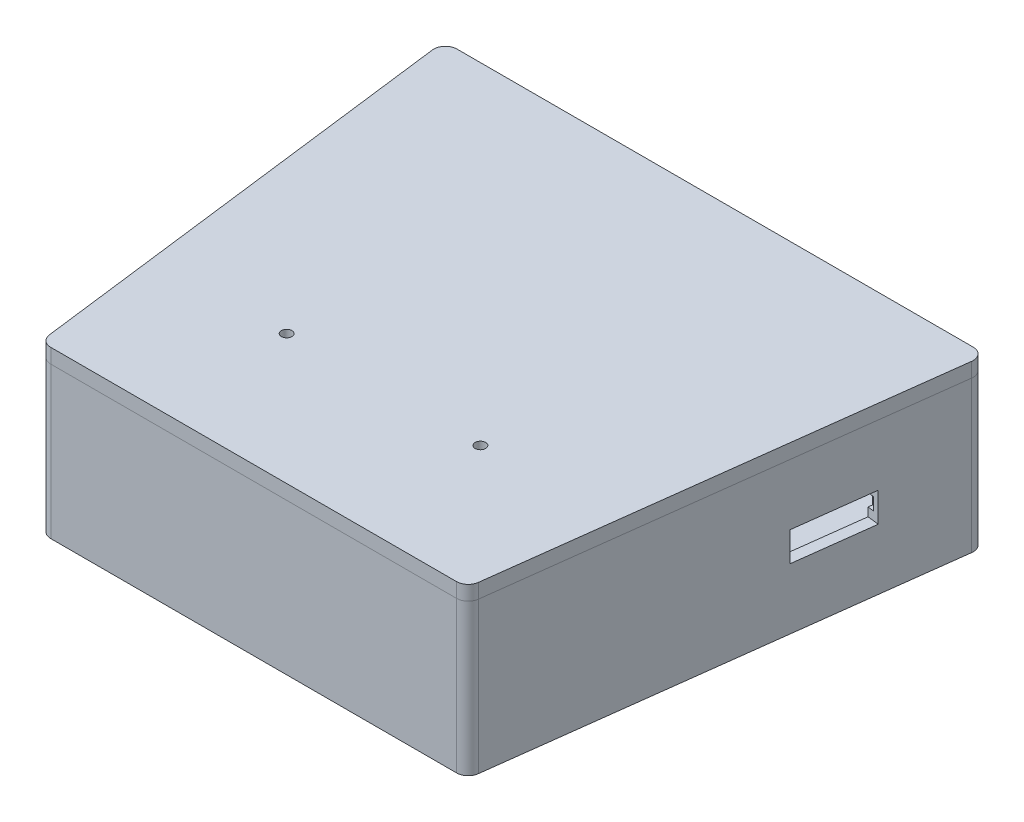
from build123d import *

# Parameters (mm, degrees)
BOSS_EXTRUDE1_DEPTH = 5.08
BOSS_EXTRUDE2_DEPTH = 44.45
CUT_EXTRUDE1_REACH  = 226.761
SKETCH3_R           = 3.175
CUT_EXTRUDE2_REACH  = 226.761
SKETCH4_R           = 11.43
CUT_EXTRUDE3_REACH  = 237.306
SKETCH6_W           = 25.908
SKETCH6_H           = 9.652
SKETCH7_W           = 1.27
SKETCH7_H           = 4.064
CUT_EXTRUDE4_DEPTH  = 2.032
SKETCH10_R          = 22.86
SKETCH10_R_2        = 1.7272
BOSS_EXTRUDE3_DEPTH = 44.45
FILLET1_R           = 1.27
FILLET2_R           = 3.81
FILLET3_R           = 3.81
SKETCH16_R          = 1.7272
BOSS_EXTRUDE4_DEPTH = 4.7625


with BuildPart() as part:
    # Sketch1 → Boss-Extrude1 (new body)
    with BuildSketch(Plane(origin=(0, 0, 0), x_dir=(1, 0, 0), z_dir=(0, 1, 0))):
        Polygon((0, 0), (139.7, 0), (158.75, 151.204687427), (-19.05, 151.204687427), align=None)
    extrude(amount=BOSS_EXTRUDE1_DEPTH)

    # Sketch2 → Boss-Extrude2 (add)
    with BuildSketch(Plane(origin=(0, 5.08, 0), x_dir=(1, 0, 0), z_dir=(0, 1, 0))):
        Polygon((-19.05, 151.204687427), (158.75, 151.204687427), (139.7, 0), (0, 0), align=None)
        Polygon((-14.729866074, 147.394687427), (3.360104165, 3.81), (136.339895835, 3.81), (154.429866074, 147.394687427), align=None, mode=Mode.SUBTRACT)
    extrude(amount=BOSS_EXTRUDE2_DEPTH)

    # Sketch3 → Cut-Extrude1 (cut, up to next)
    with BuildSketch(Plane(origin=(0, 0, -151.204687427), x_dir=(-1, 0, 0), z_dir=(0, 0, -1)), mode=Mode.PRIVATE) as cut_extrude1_sk1:
        with Locations((-79.375, 38.1)):
            Circle(SKETCH3_R)
    cut_extrude1_tool1 = extrude(cut_extrude1_sk1.sketch, amount=-CUT_EXTRUDE1_REACH, mode=Mode.PRIVATE) & part.part
    # Sketch3 → Cut-Extrude1 (cut, up to next)
    with BuildSketch(Plane(origin=(0, 0, -151.204687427), x_dir=(-1, 0, 0), z_dir=(0, 0, -1)), mode=Mode.PRIVATE) as cut_extrude1_sk2:
        with Locations(Location((-60.325, 38.1, 0), (0, 0, 180))):
            Circle(SKETCH3_R)
    cut_extrude1_tool2 = extrude(cut_extrude1_sk2.sketch, amount=-CUT_EXTRUDE1_REACH, mode=Mode.PRIVATE) & part.part
    add(cut_extrude1_tool1.solids().sort_by_distance((79.375, 38.1, -151.204687))[0], mode=Mode.SUBTRACT)
    add(cut_extrude1_tool2.solids().sort_by_distance((60.325, 38.1, -151.204687))[0], mode=Mode.SUBTRACT)

    # Sketch4 → Cut-Extrude2 (cut, up to next)
    with BuildSketch(Plane.XZ, mode=Mode.PRIVATE) as cut_extrude2_sk1:
        with Locations(Location((69.85, -124.534687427, 0), (0, 0, 270))):
            Circle(SKETCH4_R)
    cut_extrude2_tool1 = extrude(cut_extrude2_sk1.sketch, amount=-CUT_EXTRUDE2_REACH, mode=Mode.PRIVATE) & part.part
    add(cut_extrude2_tool1.solids().sort_by_distance((69.85, 0, -124.534687))[0], mode=Mode.SUBTRACT)

    # Sketch6 → Cut-Extrude3 (cut, up to next)
    with BuildSketch(Plane(origin=(137.5171875, 0, 17.325537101), x_dir=(0.12499999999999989, 0, -0.9921567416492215), z_dir=(0.9921567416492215, 0, 0.12499999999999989)), mode=Mode.PRIVATE) as cut_extrude3_sk1:
        with Locations((125.1585, 24.765)):
            Rectangle(SKETCH6_W, SKETCH6_H)
    cut_extrude3_tool1 = extrude(cut_extrude3_sk1.sketch, amount=-CUT_EXTRUDE3_REACH, mode=Mode.PRIVATE) & part.part
    cut_extrude3 = cut_extrude3_tool1.solids().sort_by_distance((153.162, 24.765, -106.851312))[0]
    add(cut_extrude3, mode=Mode.SUBTRACT)

    # Sketch7 → Cut-Extrude4 (cut)
    with BuildSketch(Plane(origin=(133.737070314, 0, 16.849287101), x_dir=(-0.12499999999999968, 0, 0.9921567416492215), z_dir=(-0.9921567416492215, 0, -0.12499999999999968))):
        with Locations((-138.7475, 24.765)):
            Rectangle(SKETCH7_W, SKETCH7_H)
        with Locations((-111.5695, 24.765)):
            Rectangle(SKETCH7_W, SKETCH7_H)
    cut_extrude4 = extrude(amount=-CUT_EXTRUDE4_DEPTH, mode=Mode.SUBTRACT)

    # Mirror3: Cut-Extrude4 across plane
    add(cut_extrude4.mirror(Plane(origin=(69.85, 0, 0), x_dir=(0, 0, 1), z_dir=(1, 0, 0))), mode=Mode.SUBTRACT)

    # Sketch10 → Boss-Extrude3 (add)
    # profile 1 of 3: a face of its own
    with BuildSketch(Plane(origin=(0, 5.08, 0), x_dir=(1, 0, 0), z_dir=(0, 1, 0))):
        with Locations(Location((38.1, 42.545, 0), (0, 0, 90))):
            Circle(SKETCH10_R)
        with Locations(Location((38.1, 42.545, 0), (0, 0, 270))):
            Circle(SKETCH10_R_2, mode=Mode.SUBTRACT)
    # profile 2 of 3: a face of its own
    with BuildSketch(Plane(origin=(0, 5.08, 0), x_dir=(1, 0, 0), z_dir=(0, 1, 0))):
        with Locations(Location((101.6, 42.545, 0), (0, 0, 270))):
            Circle(SKETCH10_R)
        with Locations(Location((101.6, 42.545, 0), (0, 0, 90))):
            Circle(SKETCH10_R_2, mode=Mode.SUBTRACT)
    # profile 3 of 3: a face of its own
    with BuildSketch(Plane(origin=(0, 5.08, 0), x_dir=(1, 0, 0), z_dir=(0, 1, 0))):
        with BuildLine():
            Line((38.1, 13.97), (101.6, 13.97))
            ThreePointArc((101.6, 13.97), (130.175, 42.545), (101.6, 71.12))
            Line((101.6, 71.12), (101.6, 74.93))
            ThreePointArc((101.6, 74.93), (133.985, 42.545), (101.6, 10.16))
            Line((101.6, 10.16), (38.1, 10.16))
            ThreePointArc((38.1, 10.16), (5.715, 42.545), (38.1, 74.93))
            Line((38.1, 74.93), (38.1, 71.12))
            ThreePointArc((38.1, 71.12), (9.525, 42.545), (38.1, 13.97))
        make_face()
    extrude(amount=BOSS_EXTRUDE3_DEPTH)

    # Sketch14 → Cut-Revolve1 (revolve, cut)
    with BuildSketch(Plane(origin=(38.1, 0, 0), x_dir=(0, 0, -1), z_dir=(1, 0, 0))):
        with BuildLine():
            ThreePointArc((65.405, 5.08), (59.055, 27.305), (65.405, 49.53))
            Line((65.405, 49.53), (65.405, 5.08))
        make_face()
    revolve(axis=Axis((38.1, 5.08, -42.545), (0, 1, 0)), mode=Mode.SUBTRACT)

    # Sketch15 → Cut-Revolve2 (revolve, cut)
    with BuildSketch(Plane(origin=(101.6, 0, 0), x_dir=(0, 0, -1), z_dir=(1, 0, 0))):
        with BuildLine():
            Line((65.405, 5.08), (65.405, 49.53))
            ThreePointArc((65.405, 49.53), (59.055, 27.305), (65.405, 5.08))
        make_face()
    revolve(axis=Axis((101.6, 5.08, -42.545), (0, 1, 0)), mode=Mode.SUBTRACT)

    # Fillet1
    fillet1_edges = [part.edges().sort_by_distance(p)[0] for p in [
        (101.6, 27.305, -74.93),
        (101.6, 27.305, -71.12),
        (38.1, 27.305, -71.12),
        (38.1, 27.305, -74.93),
    ]]
    fillet(fillet1_edges, radius=FILLET1_R)

    # Fillet2
    fillet2_edges = [part.edges().sort_by_distance(p)[0] for p in [
        (-14.729866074, 27.305, -147.394687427),
        (3.360104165, 27.305, -3.81),
        (136.339895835, 27.305, -3.81),
        (154.429866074, 27.305, -147.394687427),
        (-19.05, 24.765, -151.204687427),
        (158.75, 24.765, -151.204687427),
        (139.7, 24.765, 0),
        (0, 24.765, 0),
    ]]
    fillet(fillet2_edges, radius=FILLET2_R)

    # Mirror4: Cut-Extrude3 across plane
    add(cut_extrude3.mirror(Plane(origin=(69.85, 0, 0), x_dir=(0, 0, 1), z_dir=(1, 0, 0))), mode=Mode.SUBTRACT)

    # Fillet3
    fillet3_edges = [part.edges().sort_by_distance(p)[0] for p in [
        (69.85, 5.08, -113.104687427),
    ]]
    fillet(fillet3_edges, radius=FILLET3_R)


with BuildPart() as body_2:
    # Sketch16 → Boss-Extrude4 (new body)
    with BuildSketch(Plane(origin=(0, 49.53, 0), x_dir=(1, 0, 0), z_dir=(0, 1, 0))):
        with BuildLine():
            Line((154.429866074, 151.204687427), (-14.729866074, 151.204687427))
            ThreePointArc((-14.729866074, 151.204687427), (-17.587366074, 149.914765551), (-18.509983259, 146.918437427))
            Line((-18.509983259, 146.918437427), (-0.420013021, 3.33375))
            ThreePointArc((-0.420013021, 3.33375), (0.840026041, 0.9525), (3.360104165, 0))
            Line((3.360104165, 0), (136.339895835, 0))
            ThreePointArc((136.339895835, 0), (138.859973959, 0.9525), (140.120013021, 3.33375))
            Line((140.120013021, 3.33375), (158.209983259, 146.918437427))
            ThreePointArc((158.209983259, 146.918437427), (157.287366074, 149.914765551), (154.429866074, 151.204687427))
        make_face()
        with Locations(Location((101.6, 42.545, 0), (0, 0, 90))):
            Circle(SKETCH16_R, mode=Mode.SUBTRACT)
        with Locations(Location((38.1, 42.545, 0), (0, 0, 90))):
            Circle(SKETCH16_R, mode=Mode.SUBTRACT)
    extrude(amount=BOSS_EXTRUDE4_DEPTH)


solid = Compound([part.part, body_2.part])
